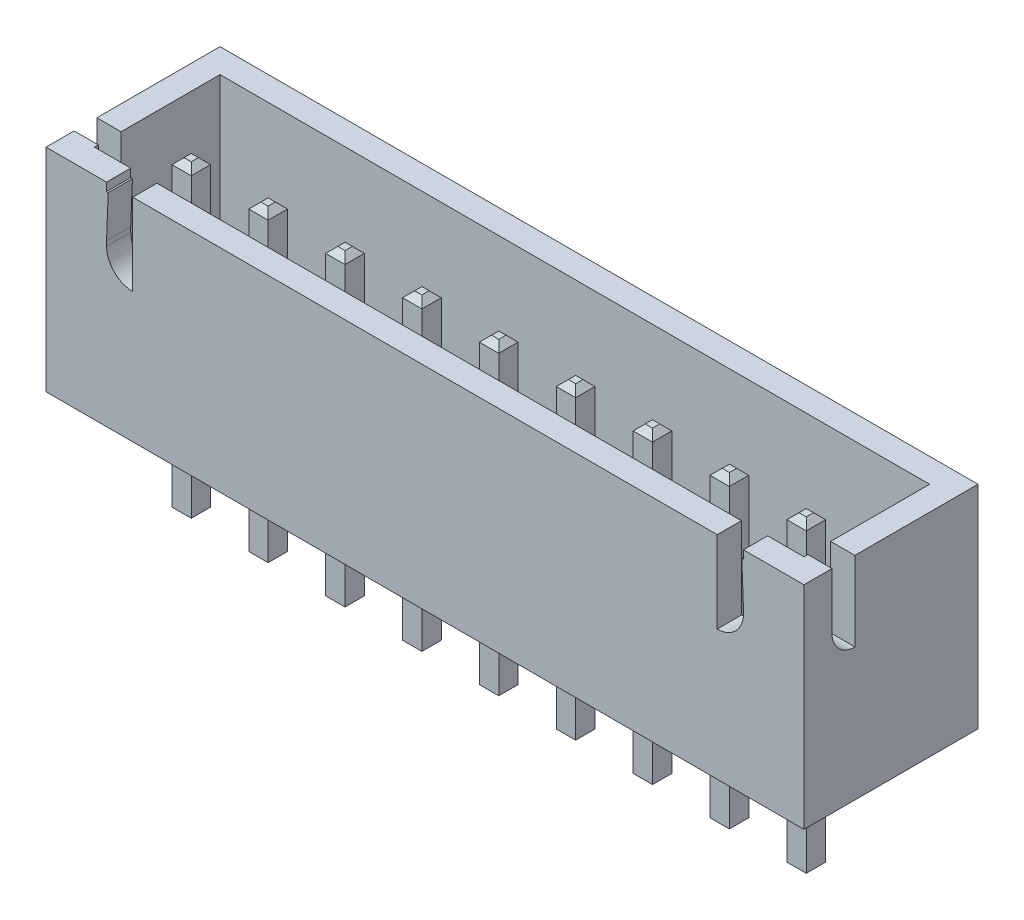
from build123d import *

# Parameters (mm, degrees)
SKETCH1_W                = 25.0444
SKETCH1_H                = 5.75
BOSS_EXTRUDE1_DEPTH      = 7
SHELL1_T                 = -0.8
CUT_EXTRUDE1_DEPTH       = 27.162713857
CUT_EXTRUDE2_REACH       = 17.455
BOSS_EXTRUDE2_DEPTH      = 3.45
BOSS_EXTRUDE2_DEPTH_BACK = 6.75
SKETCH4_W                = 0.64
SKETCH4_H                = 0.64
CHAMFER1_SIZE            = 0.2


with BuildPart() as part:
    # Sketch1 → Boss-Extrude1 (new body)
    with BuildSketch(Plane(origin=(0, 0, 0), x_dir=(1, 0, 0), z_dir=(0, 1, 0))):
        Rectangle(SKETCH1_W, SKETCH1_H)
    extrude(amount=BOSS_EXTRUDE1_DEPTH)

    # Shell1
    shell1_openings = [part.faces().sort_by_distance(p)[0] for p in [
        (0, 7, 0),
    ]]
    offset(amount=SHELL1_T, openings=shell1_openings, kind=Kind.INTERSECTION)

    # Sketch2 → Cut-Extrude1 (cut, through all)
    with BuildSketch(Plane(origin=(12.5222, 0, 0), x_dir=(0, 0, -1), z_dir=(1, 0, 0))):
        with BuildLine():
            Line((-1.19301282, 7), (-1.19301282, 4.379603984))
            ThreePointArc((-1.19301282, 4.379603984), (-1.72610374, 4.600417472), (-1.946917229, 5.133508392))
            Line((-1.946917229, 5.133508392), (-1.946917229, 7))
            Line((-1.946917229, 7), (-1.19301282, 7))
        make_face()
    extrude(amount=-CUT_EXTRUDE1_DEPTH, mode=Mode.SUBTRACT)

    # Sketch3 → Cut-Extrude2 (cut, up to next)
    with BuildSketch(Plane.XY.offset(2.875), mode=Mode.PRIVATE) as cut_extrude2_sk1:
        with BuildLine():
            Line((-10.5222, 7), (-10.5222, 6.728922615))
            Line((-10.5222, 6.728922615), (-10.467064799, 6.726764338))
            Line((-10.467064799, 6.726764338), (-10.5222, 5.318284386))
            Line((-10.5222, 5.318284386), (-10.5222, 5.166308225))
            ThreePointArc((-10.5222, 5.166308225), (-10.268486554, 4.553789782), (-9.65596811, 4.300076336))
            Line((-9.65596811, 4.300076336), (-9.65596811, 7))
            Line((-9.65596811, 7), (-10.5222, 7))
        make_face()
    cut_extrude2_tool1 = extrude(cut_extrude2_sk1.sketch, amount=-CUT_EXTRUDE2_REACH, mode=Mode.PRIVATE) & part.part
    # Sketch3 → Cut-Extrude2 (cut, up to next)
    with BuildSketch(Plane.XY.offset(2.875), mode=Mode.PRIVATE) as cut_extrude2_sk2:
        with BuildLine():
            Line((9.65596811, 7), (10.5222, 7))
            Line((10.5222, 7), (10.5222, 6.728922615))
            Line((10.5222, 6.728922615), (10.467064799, 6.726764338))
            Line((10.467064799, 6.726764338), (10.5222, 5.318284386))
            Line((10.5222, 5.318284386), (10.5222, 5.166308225))
            ThreePointArc((10.5222, 5.166308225), (10.268486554, 4.553789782), (9.65596811, 4.300076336))
            Line((9.65596811, 4.300076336), (9.65596811, 7))
        make_face()
    cut_extrude2_tool2 = extrude(cut_extrude2_sk2.sketch, amount=-CUT_EXTRUDE2_REACH, mode=Mode.PRIVATE) & part.part
    add(cut_extrude2_tool1.solids().sort_by_distance((-10.063502, 5.726052, 2.875))[0], mode=Mode.SUBTRACT)
    add(cut_extrude2_tool2.solids().sort_by_distance((10.063502, 5.726052, 2.875))[0], mode=Mode.SUBTRACT)

    # Sketch4 → Boss-Extrude2 (add, two sides: drawn at the far end of the back side and taken through both)
    with BuildSketch(Plane.XZ.offset(-BOSS_EXTRUDE2_DEPTH_BACK)):
        with Locations((-10.0722, 0.525)):
            Rectangle(SKETCH4_W, SKETCH4_H)
        with Locations((-7.5322, 0.525)):
            Rectangle(SKETCH4_W, SKETCH4_H)
        with Locations((-4.9922, 0.525)):
            Rectangle(SKETCH4_W, SKETCH4_H)
        with Locations((-2.4522, 0.525)):
            Rectangle(SKETCH4_W, SKETCH4_H)
        with Locations((0.0878, 0.525)):
            Rectangle(SKETCH4_W, SKETCH4_H)
        with Locations((2.6278, 0.525)):
            Rectangle(SKETCH4_W, SKETCH4_H)
        with Locations((5.1678, 0.525)):
            Rectangle(SKETCH4_W, SKETCH4_H)
        with Locations((7.7078, 0.525)):
            Rectangle(SKETCH4_W, SKETCH4_H)
        with Locations((10.2478, 0.525)):
            Rectangle(SKETCH4_W, SKETCH4_H)
    extrude(amount=BOSS_EXTRUDE2_DEPTH + BOSS_EXTRUDE2_DEPTH_BACK)

    # Chamfer1
    chamfer1_edges = [part.edges().sort_by_distance(p)[0] for p in [
        (-9.7522, 6.75, 0.525),
        (-10.0722, 6.75, 0.205),
        (-10.3922, 6.75, 0.525),
        (-10.0722, 6.75, 0.845),
        (-9.7522, -3.45, 0.525),
        (-10.0722, -3.45, 0.845),
        (-10.3922, -3.45, 0.525),
        (-10.0722, -3.45, 0.205),
        (-7.2122, 6.75, 0.525),
        (-7.5322, 6.75, 0.205),
        (-7.8522, 6.75, 0.525),
        (-7.5322, 6.75, 0.845),
        (-7.2122, -3.45, 0.525),
        (-7.5322, -3.45, 0.845),
        (-7.8522, -3.45, 0.525),
        (-7.5322, -3.45, 0.205),
        (-4.6722, 6.75, 0.525),
        (-4.9922, 6.75, 0.205),
        (-5.3122, 6.75, 0.525),
        (-4.9922, 6.75, 0.845),
        (-4.6722, -3.45, 0.525),
        (-4.9922, -3.45, 0.845),
        (-5.3122, -3.45, 0.525),
        (-4.9922, -3.45, 0.205),
        (-2.1322, 6.75, 0.525),
        (-2.4522, 6.75, 0.205),
        (-2.7722, 6.75, 0.525),
        (-2.4522, 6.75, 0.845),
        (-2.1322, -3.45, 0.525),
        (-2.4522, -3.45, 0.845),
        (-2.7722, -3.45, 0.525),
        (-2.4522, -3.45, 0.205),
        (0.4078, 6.75, 0.525),
        (0.0878, 6.75, 0.205),
        (-0.2322, 6.75, 0.525),
        (0.0878, 6.75, 0.845),
        (0.4078, -3.45, 0.525),
        (0.0878, -3.45, 0.845),
        (-0.2322, -3.45, 0.525),
        (0.0878, -3.45, 0.205),
        (2.9478, 6.75, 0.525),
        (2.6278, 6.75, 0.205),
        (2.3078, 6.75, 0.525),
        (2.6278, 6.75, 0.845),
        (2.9478, -3.45, 0.525),
        (2.6278, -3.45, 0.845),
        (2.3078, -3.45, 0.525),
        (2.6278, -3.45, 0.205),
        (5.4878, 6.75, 0.525),
        (5.1678, 6.75, 0.205),
        (4.8478, 6.75, 0.525),
        (5.1678, 6.75, 0.845),
        (5.4878, -3.45, 0.525),
        (5.1678, -3.45, 0.845),
        (4.8478, -3.45, 0.525),
        (5.1678, -3.45, 0.205),
        (8.0278, 6.75, 0.525),
        (7.7078, 6.75, 0.205),
        (7.3878, 6.75, 0.525),
        (7.7078, 6.75, 0.845),
        (8.0278, -3.45, 0.525),
        (7.7078, -3.45, 0.845),
        (7.3878, -3.45, 0.525),
        (7.7078, -3.45, 0.205),
        (10.5678, 6.75, 0.525),
        (10.2478, 6.75, 0.205),
        (9.9278, 6.75, 0.525),
        (10.2478, 6.75, 0.845),
        (10.5678, -3.45, 0.525),
        (10.2478, -3.45, 0.845),
        (9.9278, -3.45, 0.525),
        (10.2478, -3.45, 0.205),
    ]]
    chamfer(chamfer1_edges, length=CHAMFER1_SIZE)


solid = part.part
